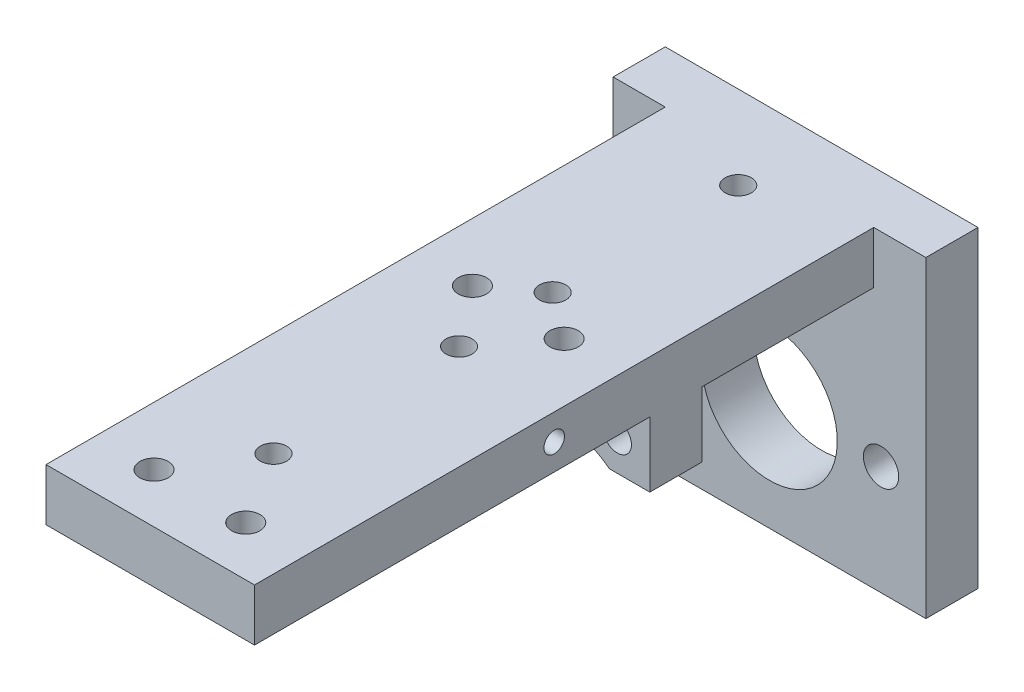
ISO-10303-21;
HEADER;
FILE_DESCRIPTION(('STEP AP214'),'2;1');
FILE_NAME('part.step','',(''),(''),'','','');
FILE_SCHEMA(('AUTOMOTIVE_DESIGN { 1 0 10303 214 1 1 1 1 }'));
ENDSEC;
DATA;
#1=APPLICATION_CONTEXT('core data for automotive mechanical design processes');
#2=APPLICATION_PROTOCOL_DEFINITION('international standard','automotive_design',2000,#1);
#3=PRODUCT_CONTEXT('',#1,'mechanical');
#4=PRODUCT('Part','Part','',(#3));
#5=PRODUCT_RELATED_PRODUCT_CATEGORY('part','',(#4));
#6=PRODUCT_DEFINITION_FORMATION('','',#4);
#7=PRODUCT_DEFINITION_CONTEXT('part definition',#1,'design');
#8=PRODUCT_DEFINITION('design','',#6,#7);
#9=PRODUCT_DEFINITION_SHAPE('','',#8);
#10=(LENGTH_UNIT() NAMED_UNIT(*) SI_UNIT(.MILLI.,.METRE.));
#11=(NAMED_UNIT(*) PLANE_ANGLE_UNIT() SI_UNIT($,.RADIAN.));
#12=(NAMED_UNIT(*) SI_UNIT($,.STERADIAN.) SOLID_ANGLE_UNIT());
#13=UNCERTAINTY_MEASURE_WITH_UNIT(LENGTH_MEASURE(1.E-05),#10,'distance_accuracy_value','');
#14=(GEOMETRIC_REPRESENTATION_CONTEXT(3) GLOBAL_UNCERTAINTY_ASSIGNED_CONTEXT((#13)) GLOBAL_UNIT_ASSIGNED_CONTEXT((#10,
#11,#12)) REPRESENTATION_CONTEXT('',''));
#15=CARTESIAN_POINT('',(0.,0.,0.));
#16=DIRECTION('',(0.,0.,1.));
#17=DIRECTION('',(1.,0.,0.));
#18=AXIS2_PLACEMENT_3D('',#15,#16,#17);
#19=CARTESIAN_POINT('',(-22.8649597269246,-14.2875,27.2796));
#20=DIRECTION('',(0.,-1.,0.));
#21=DIRECTION('',(1.,0.,0.));
#22=AXIS2_PLACEMENT_3D('',#19,#20,#21);
#23=PLANE('',#22);
#24=DIRECTION('',(0.,0.,1.));
#25=VECTOR('',#24,1.);
#26=CARTESIAN_POINT('',(7.79754144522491,-14.2875,-0.00100000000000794));
#27=LINE('',#26,#25);
#28=CARTESIAN_POINT('',(7.79754144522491,-14.2875,33.6296));
#29=VERTEX_POINT('',#28);
#30=CARTESIAN_POINT('',(7.79754144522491,-14.2875,27.2796));
#31=VERTEX_POINT('',#30);
#32=EDGE_CURVE('E47',#29,#31,#27,.F.);
#33=ORIENTED_EDGE('',*,*,#32,.T.);
#34=DIRECTION('',(1.,0.,0.));
#35=VECTOR('',#34,1.);
#36=CARTESIAN_POINT('',(-22.8649597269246,-14.2875,27.2796));
#37=LINE('',#36,#35);
#38=CARTESIAN_POINT('',(12.7,-14.2875,27.2796));
#39=VERTEX_POINT('',#38);
#40=EDGE_CURVE('E242',#31,#39,#37,.T.);
#41=ORIENTED_EDGE('',*,*,#40,.T.);
#42=DIRECTION('',(0.,0.,-1.));
#43=VECTOR('',#42,1.);
#44=CARTESIAN_POINT('',(12.7,-14.2875,27.2796));
#45=LINE('',#44,#43);
#46=CARTESIAN_POINT('',(12.7,-14.2875,33.6296));
#47=VERTEX_POINT('',#46);
#48=EDGE_CURVE('E252',#47,#39,#45,.T.);
#49=ORIENTED_EDGE('',*,*,#48,.F.);
#50=DIRECTION('',(1.,0.,0.));
#51=VECTOR('',#50,1.);
#52=CARTESIAN_POINT('',(-22.8649597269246,-14.2875,33.6296));
#53=LINE('',#52,#51);
#54=EDGE_CURVE('E243',#29,#47,#53,.T.);
#55=ORIENTED_EDGE('',*,*,#54,.F.);
#56=EDGE_LOOP('',(#33,#41,#49,#55));
#57=FACE_BOUND('',#56,.T.);
#58=ADVANCED_FACE('F30',(#57),#23,.T.);
#59=CARTESIAN_POINT('',(19.05,0.,0.));
#60=DIRECTION('',(0.,-1.,0.));
#61=DIRECTION('',(0.,0.,-1.));
#62=AXIS2_PLACEMENT_3D('',#59,#60,#61);
#63=PLANE('',#62);
#64=CARTESIAN_POINT('',(5.588,0.,36.957));
#65=DIRECTION('',(0.,1.,0.));
#66=DIRECTION('',(0.,0.,1.));
#67=AXIS2_PLACEMENT_3D('',#64,#65,#66);
#68=CIRCLE('',#67,1.72719999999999);
#69=CARTESIAN_POINT('',(5.588,0.,38.6842));
#70=VERTEX_POINT('',#69);
#71=EDGE_CURVE('E519',#70,#70,#68,.T.);
#72=ORIENTED_EDGE('',*,*,#71,.F.);
#73=EDGE_LOOP('',(#72));
#74=FACE_BOUND('',#73,.T.);
#75=CARTESIAN_POINT('',(-5.588,0.,75.7428));
#76=DIRECTION('',(0.,1.,0.));
#77=DIRECTION('',(0.,0.,1.));
#78=AXIS2_PLACEMENT_3D('',#75,#76,#77);
#79=CIRCLE('',#78,1.72719999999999);
#80=CARTESIAN_POINT('',(-5.588,0.,77.47));
#81=VERTEX_POINT('',#80);
#82=EDGE_CURVE('E507',#81,#81,#79,.T.);
#83=ORIENTED_EDGE('',*,*,#82,.F.);
#84=EDGE_LOOP('',(#83));
#85=FACE_BOUND('',#84,.T.);
#86=CARTESIAN_POINT('',(0.,0.,32.766));
#87=DIRECTION('',(0.,-1.,0.));
#88=DIRECTION('',(0.,0.,-1.));
#89=AXIS2_PLACEMENT_3D('',#86,#87,#88);
#90=CIRCLE('',#89,1.6);
#91=CARTESIAN_POINT('',(0.,0.,31.166));
#92=VERTEX_POINT('',#91);
#93=EDGE_CURVE('E282',#92,#92,#90,.T.);
#94=ORIENTED_EDGE('',*,*,#93,.T.);
#95=EDGE_LOOP('',(#94));
#96=FACE_BOUND('',#95,.T.);
#97=CARTESIAN_POINT('',(0.,0.,66.7766));
#98=DIRECTION('',(0.,-1.,0.));
#99=DIRECTION('',(0.,0.,-1.));
#100=AXIS2_PLACEMENT_3D('',#97,#98,#99);
#101=CIRCLE('',#100,1.6);
#102=CARTESIAN_POINT('',(0.,0.,65.1766));
#103=VERTEX_POINT('',#102);
#104=EDGE_CURVE('E295',#103,#103,#101,.T.);
#105=ORIENTED_EDGE('',*,*,#104,.T.);
#106=EDGE_LOOP('',(#105));
#107=FACE_BOUND('',#106,.T.);
#108=CARTESIAN_POINT('',(0.,0.,10.16));
#109=DIRECTION('',(0.,-1.,0.));
#110=DIRECTION('',(0.,0.,-1.));
#111=AXIS2_PLACEMENT_3D('',#108,#109,#110);
#112=CIRCLE('',#111,1.6);
#113=CARTESIAN_POINT('',(0.,0.,8.56));
#114=VERTEX_POINT('',#113);
#115=EDGE_CURVE('E307',#114,#114,#112,.T.);
#116=ORIENTED_EDGE('',*,*,#115,.T.);
#117=EDGE_LOOP('',(#116));
#118=FACE_BOUND('',#117,.T.);
#119=CARTESIAN_POINT('',(0.,0.,44.1706));
#120=DIRECTION('',(0.,-1.,0.));
#121=DIRECTION('',(0.,0.,-1.));
#122=AXIS2_PLACEMENT_3D('',#119,#120,#121);
#123=CIRCLE('',#122,1.6);
#124=CARTESIAN_POINT('',(0.,0.,42.5706));
#125=VERTEX_POINT('',#124);
#126=EDGE_CURVE('E319',#125,#125,#123,.T.);
#127=ORIENTED_EDGE('',*,*,#126,.T.);
#128=EDGE_LOOP('',(#127));
#129=FACE_BOUND('',#128,.T.);
#130=DIRECTION('',(1.,0.,0.));
#131=VECTOR('',#130,1.);
#132=CARTESIAN_POINT('',(-19.05,0.,6.35));
#133=LINE('',#132,#131);
#134=CARTESIAN_POINT('',(-19.05,0.,6.35));
#135=VERTEX_POINT('',#134);
#136=CARTESIAN_POINT('',(-12.7,0.,6.35));
#137=VERTEX_POINT('',#136);
#138=EDGE_CURVE('E253',#135,#137,#133,.T.);
#139=ORIENTED_EDGE('',*,*,#138,.T.);
#140=DIRECTION('',(0.,0.,1.));
#141=VECTOR('',#140,1.);
#142=CARTESIAN_POINT('',(-12.7,0.,81.788));
#143=LINE('',#142,#141);
#144=CARTESIAN_POINT('',(-12.7,0.,81.788));
#145=VERTEX_POINT('',#144);
#146=EDGE_CURVE('E256',#137,#145,#143,.T.);
#147=ORIENTED_EDGE('',*,*,#146,.T.);
#148=DIRECTION('',(-1.,0.,0.));
#149=VECTOR('',#148,1.);
#150=CARTESIAN_POINT('',(19.05,0.,81.788));
#151=LINE('',#150,#149);
#152=CARTESIAN_POINT('',(12.7,0.,81.788));
#153=VERTEX_POINT('',#152);
#154=EDGE_CURVE('E39',#153,#145,#151,.T.);
#155=ORIENTED_EDGE('',*,*,#154,.F.);
#156=DIRECTION('',(0.,0.,-1.));
#157=VECTOR('',#156,1.);
#158=CARTESIAN_POINT('',(12.7,0.,81.788));
#159=LINE('',#158,#157);
#160=CARTESIAN_POINT('',(12.7,0.,6.35));
#161=VERTEX_POINT('',#160);
#162=EDGE_CURVE('E269',#153,#161,#159,.T.);
#163=ORIENTED_EDGE('',*,*,#162,.T.);
#164=DIRECTION('',(1.,0.,0.));
#165=VECTOR('',#164,1.);
#166=CARTESIAN_POINT('',(19.05,0.,6.35));
#167=LINE('',#166,#165);
#168=CARTESIAN_POINT('',(19.05,0.,6.35));
#169=VERTEX_POINT('',#168);
#170=EDGE_CURVE('E272',#161,#169,#167,.T.);
#171=ORIENTED_EDGE('',*,*,#170,.T.);
#172=DIRECTION('',(0.,0.,1.));
#173=VECTOR('',#172,1.);
#174=CARTESIAN_POINT('',(19.05,0.,0.));
#175=LINE('',#174,#173);
#176=CARTESIAN_POINT('',(19.05,0.,0.));
#177=VERTEX_POINT('',#176);
#178=EDGE_CURVE('E349',#177,#169,#175,.T.);
#179=ORIENTED_EDGE('',*,*,#178,.F.);
#180=DIRECTION('',(-1.,0.,0.));
#181=VECTOR('',#180,1.);
#182=CARTESIAN_POINT('',(19.05,0.,0.));
#183=LINE('',#182,#181);
#184=CARTESIAN_POINT('',(-19.05,0.,0.));
#185=VERTEX_POINT('',#184);
#186=EDGE_CURVE('E11',#177,#185,#183,.T.);
#187=ORIENTED_EDGE('',*,*,#186,.T.);
#188=DIRECTION('',(0.,0.,1.));
#189=VECTOR('',#188,1.);
#190=CARTESIAN_POINT('',(-19.05,0.,0.));
#191=LINE('',#190,#189);
#192=EDGE_CURVE('E360',#185,#135,#191,.T.);
#193=ORIENTED_EDGE('',*,*,#192,.T.);
#194=EDGE_LOOP('',(#139,#147,#155,#163,#171,#179,#187,#193));
#195=FACE_BOUND('',#194,.T.);
#196=CARTESIAN_POINT('',(5.588,0.,75.7428));
#197=DIRECTION('',(0.,1.,0.));
#198=DIRECTION('',(0.,0.,1.));
#199=AXIS2_PLACEMENT_3D('',#196,#197,#198);
#200=CIRCLE('',#199,1.72719999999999);
#201=CARTESIAN_POINT('',(5.588,0.,77.47));
#202=VERTEX_POINT('',#201);
#203=EDGE_CURVE('E513',#202,#202,#200,.T.);
#204=ORIENTED_EDGE('',*,*,#203,.F.);
#205=EDGE_LOOP('',(#204));
#206=FACE_BOUND('',#205,.T.);
#207=CARTESIAN_POINT('',(-5.588,0.,36.957));
#208=DIRECTION('',(0.,1.,0.));
#209=DIRECTION('',(0.,0.,1.));
#210=AXIS2_PLACEMENT_3D('',#207,#208,#209);
#211=CIRCLE('',#210,1.72719999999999);
#212=CARTESIAN_POINT('',(-5.588,0.,38.6842));
#213=VERTEX_POINT('',#212);
#214=EDGE_CURVE('E489',#213,#213,#211,.T.);
#215=ORIENTED_EDGE('',*,*,#214,.F.);
#216=EDGE_LOOP('',(#215));
#217=FACE_BOUND('',#216,.T.);
#218=ADVANCED_FACE('F206',(#74,#85,#96,#107,#118,#129,#195,#206,#217),#63,.F.);
#219=CARTESIAN_POINT('',(-22.8649597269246,-6.35000000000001,33.6296));
#220=DIRECTION('',(0.,0.,1.));
#221=DIRECTION('',(1.,0.,0.));
#222=AXIS2_PLACEMENT_3D('',#219,#220,#221);
#223=PLANE('',#222);
#224=CARTESIAN_POINT('',(0.,-24.7904,33.6296));
#225=DIRECTION('',(0.,0.,1.));
#226=DIRECTION('',(1.,0.,0.));
#227=AXIS2_PLACEMENT_3D('',#224,#225,#226);
#228=CIRCLE('',#227,13.081);
#229=CARTESIAN_POINT('',(-3.13316055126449,-12.0901690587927,33.6296));
#230=VERTEX_POINT('',#229);
#231=CARTESIAN_POINT('',(-7.79754144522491,-14.2875,33.6296));
#232=VERTEX_POINT('',#231);
#233=EDGE_CURVE('E178',#230,#232,#228,.T.);
#234=ORIENTED_EDGE('',*,*,#233,.F.);
#235=DIRECTION('',(0.,-1.,0.));
#236=VECTOR('',#235,1.);
#237=CARTESIAN_POINT('',(-3.13316055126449,0.00100000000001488,33.6296));
#238=LINE('',#237,#236);
#239=CARTESIAN_POINT('',(-3.13316055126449,-6.35000000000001,33.6296));
#240=VERTEX_POINT('',#239);
#241=EDGE_CURVE('E454',#230,#240,#238,.F.);
#242=ORIENTED_EDGE('',*,*,#241,.T.);
#243=DIRECTION('',(1.,0.,0.));
#244=VECTOR('',#243,1.);
#245=CARTESIAN_POINT('',(-22.8649597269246,-6.35000000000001,33.6296));
#246=LINE('',#245,#244);
#247=CARTESIAN_POINT('',(-12.7,-6.35,33.6296));
#248=VERTEX_POINT('',#247);
#249=EDGE_CURVE('E55',#248,#240,#246,.T.);
#250=ORIENTED_EDGE('',*,*,#249,.F.);
#251=DIRECTION('',(0.,1.,0.));
#252=VECTOR('',#251,1.);
#253=CARTESIAN_POINT('',(-12.7,-6.35000000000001,33.6296));
#254=LINE('',#253,#252);
#255=CARTESIAN_POINT('',(-12.7,-14.2875,33.6296));
#256=VERTEX_POINT('',#255);
#257=EDGE_CURVE('E241',#256,#248,#254,.T.);
#258=ORIENTED_EDGE('',*,*,#257,.F.);
#259=EDGE_CURVE('E234',#256,#232,#53,.T.);
#260=ORIENTED_EDGE('',*,*,#259,.T.);
#261=EDGE_LOOP('',(#234,#242,#250,#258,#260));
#262=FACE_BOUND('',#261,.T.);
#263=CARTESIAN_POINT('',(-8.7376,-10.414,33.6296));
#264=DIRECTION('',(0.,0.,1.));
#265=DIRECTION('',(1.,0.,0.));
#266=AXIS2_PLACEMENT_3D('',#263,#264,#265);
#267=CIRCLE('',#266,1.72719999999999);
#268=CARTESIAN_POINT('',(-7.01040000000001,-10.414,33.6296));
#269=VERTEX_POINT('',#268);
#270=EDGE_CURVE('E501',#269,#269,#267,.T.);
#271=ORIENTED_EDGE('',*,*,#270,.F.);
#272=EDGE_LOOP('',(#271));
#273=FACE_BOUND('',#272,.T.);
#274=ADVANCED_FACE('F213',(#262,#273),#223,.T.);
#275=CARTESIAN_POINT('',(19.05,-6.35,6.35));
#276=DIRECTION('',(0.,1.,0.));
#277=DIRECTION('',(0.,0.,1.));
#278=AXIS2_PLACEMENT_3D('',#275,#276,#277);
#279=PLANE('',#278);
#280=CARTESIAN_POINT('',(0.,-6.35,10.16));
#281=DIRECTION('',(0.,-1.,0.));
#282=DIRECTION('',(0.,0.,-1.));
#283=AXIS2_PLACEMENT_3D('',#280,#281,#282);
#284=CIRCLE('',#283,3.25);
#285=CARTESIAN_POINT('',(0.,-6.35,6.91));
#286=VERTEX_POINT('',#285);
#287=EDGE_CURVE('E316',#286,#286,#284,.T.);
#288=ORIENTED_EDGE('',*,*,#287,.F.);
#289=EDGE_LOOP('',(#288));
#290=FACE_BOUND('',#289,.T.);
#291=DIRECTION('',(0.,0.,-1.));
#292=VECTOR('',#291,1.);
#293=CARTESIAN_POINT('',(12.7,-6.35000000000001,81.788));
#294=LINE('',#293,#292);
#295=CARTESIAN_POINT('',(12.7,-6.35000000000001,27.2796));
#296=VERTEX_POINT('',#295);
#297=CARTESIAN_POINT('',(12.7,-6.35,6.35));
#298=VERTEX_POINT('',#297);
#299=EDGE_CURVE('E267',#296,#298,#294,.T.);
#300=ORIENTED_EDGE('',*,*,#299,.F.);
#301=DIRECTION('',(1.,0.,0.));
#302=VECTOR('',#301,1.);
#303=CARTESIAN_POINT('',(-22.8649597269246,-6.35000000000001,27.2796));
#304=LINE('',#303,#302);
#305=CARTESIAN_POINT('',(-12.7,-6.35000000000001,27.2796));
#306=VERTEX_POINT('',#305);
#307=EDGE_CURVE('E250',#306,#296,#304,.T.);
#308=ORIENTED_EDGE('',*,*,#307,.F.);
#309=DIRECTION('',(0.,0.,1.));
#310=VECTOR('',#309,1.);
#311=CARTESIAN_POINT('',(-12.7,-6.35000000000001,81.788));
#312=LINE('',#311,#310);
#313=CARTESIAN_POINT('',(-12.7,-6.35,6.35));
#314=VERTEX_POINT('',#313);
#315=EDGE_CURVE('E257',#314,#306,#312,.T.);
#316=ORIENTED_EDGE('',*,*,#315,.F.);
#317=DIRECTION('',(-1.,0.,0.));
#318=VECTOR('',#317,1.);
#319=CARTESIAN_POINT('',(19.05,-6.35,6.35));
#320=LINE('',#319,#318);
#321=EDGE_CURVE('E371',#298,#314,#320,.T.);
#322=ORIENTED_EDGE('',*,*,#321,.F.);
#323=EDGE_LOOP('',(#300,#308,#316,#322));
#324=FACE_BOUND('',#323,.T.);
#325=ADVANCED_FACE('F426',(#290,#324),#279,.F.);
#326=CARTESIAN_POINT('',(19.05,0.,0.));
#327=DIRECTION('',(0.,0.,1.));
#328=DIRECTION('',(0.,-1.,0.));
#329=AXIS2_PLACEMENT_3D('',#326,#327,#328);
#330=PLANE('',#329);
#331=CARTESIAN_POINT('',(13.589,-24.7904,0.));
#332=DIRECTION('',(0.,0.,-1.));
#333=DIRECTION('',(0.,1.,0.));
#334=AXIS2_PLACEMENT_3D('',#331,#332,#333);
#335=CIRCLE('',#334,2.15265);
#336=CARTESIAN_POINT('',(13.589,-22.63775,0.));
#337=VERTEX_POINT('',#336);
#338=EDGE_CURVE('E331',#337,#337,#335,.T.);
#339=ORIENTED_EDGE('',*,*,#338,.F.);
#340=EDGE_LOOP('',(#339));
#341=FACE_BOUND('',#340,.T.);
#342=CARTESIAN_POINT('',(-13.589,-24.7904,0.));
#343=DIRECTION('',(0.,0.,-1.));
#344=DIRECTION('',(0.,1.,0.));
#345=AXIS2_PLACEMENT_3D('',#342,#343,#344);
#346=CIRCLE('',#345,2.15265);
#347=CARTESIAN_POINT('',(-13.589,-22.63775,0.));
#348=VERTEX_POINT('',#347);
#349=EDGE_CURVE('E335',#348,#348,#346,.T.);
#350=ORIENTED_EDGE('',*,*,#349,.F.);
#351=EDGE_LOOP('',(#350));
#352=FACE_BOUND('',#351,.T.);
#353=CARTESIAN_POINT('',(0.,-24.7904,0.));
#354=DIRECTION('',(0.,0.,-1.));
#355=DIRECTION('',(0.,1.,0.));
#356=AXIS2_PLACEMENT_3D('',#353,#354,#355);
#357=CIRCLE('',#356,8.255);
#358=CARTESIAN_POINT('',(0.,-16.5354,0.));
#359=VERTEX_POINT('',#358);
#360=EDGE_CURVE('E339',#359,#359,#357,.T.);
#361=ORIENTED_EDGE('',*,*,#360,.F.);
#362=EDGE_LOOP('',(#361));
#363=FACE_BOUND('',#362,.T.);
#364=DIRECTION('',(0.,1.,0.));
#365=VECTOR('',#364,1.);
#366=CARTESIAN_POINT('',(-19.05,0.,0.));
#367=LINE('',#366,#365);
#368=CARTESIAN_POINT('',(-19.05,-38.1,0.));
#369=VERTEX_POINT('',#368);
#370=EDGE_CURVE('E345',#369,#185,#367,.T.);
#371=ORIENTED_EDGE('',*,*,#370,.T.);
#372=ORIENTED_EDGE('',*,*,#186,.F.);
#373=DIRECTION('',(0.,1.,0.));
#374=VECTOR('',#373,1.);
#375=CARTESIAN_POINT('',(19.05,0.,0.));
#376=LINE('',#375,#374);
#377=CARTESIAN_POINT('',(19.05,-38.1,0.));
#378=VERTEX_POINT('',#377);
#379=EDGE_CURVE('E346',#378,#177,#376,.T.);
#380=ORIENTED_EDGE('',*,*,#379,.F.);
#381=DIRECTION('',(-1.,0.,0.));
#382=VECTOR('',#381,1.);
#383=CARTESIAN_POINT('',(19.05,-38.1,0.));
#384=LINE('',#383,#382);
#385=EDGE_CURVE('E357',#378,#369,#384,.T.);
#386=ORIENTED_EDGE('',*,*,#385,.T.);
#387=EDGE_LOOP('',(#371,#372,#380,#386));
#388=FACE_BOUND('',#387,.T.);
#389=ADVANCED_FACE('F32',(#341,#352,#363,#388),#330,.F.);
#390=CARTESIAN_POINT('',(19.05,-6.35000000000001,81.788));
#391=DIRECTION('',(0.,0.,-1.));
#392=DIRECTION('',(-1.,0.,0.));
#393=AXIS2_PLACEMENT_3D('',#390,#391,#392);
#394=PLANE('',#393);
#395=ORIENTED_EDGE('',*,*,#154,.T.);
#396=DIRECTION('',(0.,-1.,0.));
#397=VECTOR('',#396,1.);
#398=CARTESIAN_POINT('',(-12.7,0.,81.788));
#399=LINE('',#398,#397);
#400=CARTESIAN_POINT('',(-12.7,-6.35000000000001,81.788));
#401=VERTEX_POINT('',#400);
#402=EDGE_CURVE('E264',#145,#401,#399,.T.);
#403=ORIENTED_EDGE('',*,*,#402,.T.);
#404=DIRECTION('',(-1.,0.,0.));
#405=VECTOR('',#404,1.);
#406=CARTESIAN_POINT('',(19.05,-6.35000000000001,81.788));
#407=LINE('',#406,#405);
#408=CARTESIAN_POINT('',(12.7,-6.35000000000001,81.788));
#409=VERTEX_POINT('',#408);
#410=EDGE_CURVE('E374',#409,#401,#407,.T.);
#411=ORIENTED_EDGE('',*,*,#410,.F.);
#412=DIRECTION('',(0.,-1.,0.));
#413=VECTOR('',#412,1.);
#414=CARTESIAN_POINT('',(12.7,0.,81.788));
#415=LINE('',#414,#413);
#416=EDGE_CURVE('E276',#153,#409,#415,.T.);
#417=ORIENTED_EDGE('',*,*,#416,.F.);
#418=EDGE_LOOP('',(#395,#403,#411,#417));
#419=FACE_BOUND('',#418,.T.);
#420=ADVANCED_FACE('F424',(#419),#394,.F.);
#421=CARTESIAN_POINT('',(-5.588,-6.35,36.957));
#422=DIRECTION('',(0.,1.,0.));
#423=DIRECTION('',(0.,0.,1.));
#424=AXIS2_PLACEMENT_3D('',#421,#422,#423);
#425=CIRCLE('',#424,1.72719999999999);
#426=CARTESIAN_POINT('',(-5.588,-6.35,38.6842));
#427=VERTEX_POINT('',#426);
#428=EDGE_CURVE('E522',#427,#427,#425,.T.);
#429=ORIENTED_EDGE('',*,*,#428,.T.);
#430=EDGE_LOOP('',(#429));
#431=FACE_BOUND('',#430,.T.);
#432=CARTESIAN_POINT('',(5.588,-6.35,36.957));
#433=DIRECTION('',(0.,1.,0.));
#434=DIRECTION('',(0.,0.,1.));
#435=AXIS2_PLACEMENT_3D('',#432,#433,#434);
#436=CIRCLE('',#435,1.72719999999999);
#437=CARTESIAN_POINT('',(5.588,-6.35,38.6842));
#438=VERTEX_POINT('',#437);
#439=EDGE_CURVE('E516',#438,#438,#436,.T.);
#440=ORIENTED_EDGE('',*,*,#439,.T.);
#441=EDGE_LOOP('',(#440));
#442=FACE_BOUND('',#441,.T.);
#443=CARTESIAN_POINT('',(5.588,-6.35000000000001,75.7428));
#444=DIRECTION('',(0.,1.,0.));
#445=DIRECTION('',(0.,0.,1.));
#446=AXIS2_PLACEMENT_3D('',#443,#444,#445);
#447=CIRCLE('',#446,1.72719999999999);
#448=CARTESIAN_POINT('',(5.588,-6.35000000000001,77.47));
#449=VERTEX_POINT('',#448);
#450=EDGE_CURVE('E510',#449,#449,#447,.T.);
#451=ORIENTED_EDGE('',*,*,#450,.T.);
#452=EDGE_LOOP('',(#451));
#453=FACE_BOUND('',#452,.T.);
#454=CARTESIAN_POINT('',(-5.588,-6.35000000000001,75.7428));
#455=DIRECTION('',(0.,1.,0.));
#456=DIRECTION('',(0.,0.,1.));
#457=AXIS2_PLACEMENT_3D('',#454,#455,#456);
#458=CIRCLE('',#457,1.72719999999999);
#459=CARTESIAN_POINT('',(-5.588,-6.35000000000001,77.47));
#460=VERTEX_POINT('',#459);
#461=EDGE_CURVE('E504',#460,#460,#458,.T.);
#462=ORIENTED_EDGE('',*,*,#461,.T.);
#463=EDGE_LOOP('',(#462));
#464=FACE_BOUND('',#463,.T.);
#465=EDGE_CURVE('E263',#248,#401,#312,.T.);
#466=ORIENTED_EDGE('',*,*,#465,.F.);
#467=ORIENTED_EDGE('',*,*,#249,.T.);
#468=CARTESIAN_POINT('',(0.,-6.35,32.766));
#469=DIRECTION('',(0.,-1.,0.));
#470=DIRECTION('',(0.,0.,-1.));
#471=AXIS2_PLACEMENT_3D('',#468,#469,#470);
#472=CIRCLE('',#471,3.25);
#473=CARTESIAN_POINT('',(3.13316055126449,-6.35000000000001,33.6296));
#474=VERTEX_POINT('',#473);
#475=EDGE_CURVE('E292',#474,#240,#472,.T.);
#476=ORIENTED_EDGE('',*,*,#475,.F.);
#477=CARTESIAN_POINT('',(12.7,-6.35000000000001,33.6296));
#478=VERTEX_POINT('',#477);
#479=EDGE_CURVE('E249',#474,#478,#246,.T.);
#480=ORIENTED_EDGE('',*,*,#479,.T.);
#481=EDGE_CURVE('E273',#409,#478,#294,.T.);
#482=ORIENTED_EDGE('',*,*,#481,.F.);
#483=ORIENTED_EDGE('',*,*,#410,.T.);
#484=EDGE_LOOP('',(#466,#467,#476,#480,#482,#483));
#485=FACE_BOUND('',#484,.T.);
#486=CARTESIAN_POINT('',(0.,-6.35,66.7766));
#487=DIRECTION('',(0.,-1.,0.));
#488=DIRECTION('',(0.,0.,-1.));
#489=AXIS2_PLACEMENT_3D('',#486,#487,#488);
#490=CIRCLE('',#489,3.25);
#491=CARTESIAN_POINT('',(0.,-6.35,63.5266));
#492=VERTEX_POINT('',#491);
#493=EDGE_CURVE('E304',#492,#492,#490,.T.);
#494=ORIENTED_EDGE('',*,*,#493,.F.);
#495=EDGE_LOOP('',(#494));
#496=FACE_BOUND('',#495,.T.);
#497=CARTESIAN_POINT('',(0.,-6.35,44.1706));
#498=DIRECTION('',(0.,-1.,0.));
#499=DIRECTION('',(0.,0.,-1.));
#500=AXIS2_PLACEMENT_3D('',#497,#498,#499);
#501=CIRCLE('',#500,3.25);
#502=CARTESIAN_POINT('',(0.,-6.35,40.9206));
#503=VERTEX_POINT('',#502);
#504=EDGE_CURVE('E328',#503,#503,#501,.T.);
#505=ORIENTED_EDGE('',*,*,#504,.F.);
#506=EDGE_LOOP('',(#505));
#507=FACE_BOUND('',#506,.T.);
#508=ADVANCED_FACE('F421',(#431,#442,#453,#464,#485,#496,#507),#279,.F.);
#509=CARTESIAN_POINT('',(19.05,-6.35,6.35));
#510=DIRECTION('',(0.,0.,-1.));
#511=DIRECTION('',(0.,1.,0.));
#512=AXIS2_PLACEMENT_3D('',#509,#510,#511);
#513=PLANE('',#512);
#514=CARTESIAN_POINT('',(13.589,-24.7904,6.35));
#515=DIRECTION('',(0.,0.,-1.));
#516=DIRECTION('',(0.,1.,0.));
#517=AXIS2_PLACEMENT_3D('',#514,#515,#516);
#518=CIRCLE('',#517,2.15264999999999);
#519=CARTESIAN_POINT('',(13.589,-22.63775,6.35));
#520=VERTEX_POINT('',#519);
#521=EDGE_CURVE('E334',#520,#520,#518,.T.);
#522=ORIENTED_EDGE('',*,*,#521,.T.);
#523=EDGE_LOOP('',(#522));
#524=FACE_BOUND('',#523,.T.);
#525=CARTESIAN_POINT('',(-13.589,-24.7904,6.35));
#526=DIRECTION('',(0.,0.,-1.));
#527=DIRECTION('',(0.,1.,0.));
#528=AXIS2_PLACEMENT_3D('',#525,#526,#527);
#529=CIRCLE('',#528,2.15264999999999);
#530=CARTESIAN_POINT('',(-13.589,-22.63775,6.35));
#531=VERTEX_POINT('',#530);
#532=EDGE_CURVE('E338',#531,#531,#529,.T.);
#533=ORIENTED_EDGE('',*,*,#532,.T.);
#534=EDGE_LOOP('',(#533));
#535=FACE_BOUND('',#534,.T.);
#536=CARTESIAN_POINT('',(0.,-24.7904,6.34999999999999));
#537=DIRECTION('',(0.,0.,-1.));
#538=DIRECTION('',(0.,1.,0.));
#539=AXIS2_PLACEMENT_3D('',#536,#537,#538);
#540=CIRCLE('',#539,8.255);
#541=CARTESIAN_POINT('',(0.,-16.5354,6.35));
#542=VERTEX_POINT('',#541);
#543=EDGE_CURVE('E342',#542,#542,#540,.F.);
#544=ORIENTED_EDGE('',*,*,#543,.F.);
#545=EDGE_LOOP('',(#544));
#546=FACE_BOUND('',#545,.T.);
#547=DIRECTION('',(0.,-1.,0.));
#548=VECTOR('',#547,1.);
#549=CARTESIAN_POINT('',(-19.05,-6.35,6.35));
#550=LINE('',#549,#548);
#551=CARTESIAN_POINT('',(-19.05,-38.1,6.35));
#552=VERTEX_POINT('',#551);
#553=EDGE_CURVE('E363',#135,#552,#550,.T.);
#554=ORIENTED_EDGE('',*,*,#553,.T.);
#555=DIRECTION('',(-1.,0.,0.));
#556=VECTOR('',#555,1.);
#557=CARTESIAN_POINT('',(19.05,-38.1,6.35));
#558=LINE('',#557,#556);
#559=CARTESIAN_POINT('',(19.05,-38.1,6.35));
#560=VERTEX_POINT('',#559);
#561=EDGE_CURVE('E368',#560,#552,#558,.T.);
#562=ORIENTED_EDGE('',*,*,#561,.F.);
#563=DIRECTION('',(0.,-1.,0.));
#564=VECTOR('',#563,1.);
#565=CARTESIAN_POINT('',(19.05,-6.35,6.35));
#566=LINE('',#565,#564);
#567=EDGE_CURVE('E353',#169,#560,#566,.T.);
#568=ORIENTED_EDGE('',*,*,#567,.F.);
#569=ORIENTED_EDGE('',*,*,#170,.F.);
#570=DIRECTION('',(0.,-1.,0.));
#571=VECTOR('',#570,1.);
#572=CARTESIAN_POINT('',(12.7,0.,6.35));
#573=LINE('',#572,#571);
#574=EDGE_CURVE('E279',#161,#298,#573,.T.);
#575=ORIENTED_EDGE('',*,*,#574,.T.);
#576=ORIENTED_EDGE('',*,*,#321,.T.);
#577=DIRECTION('',(0.,-1.,0.));
#578=VECTOR('',#577,1.);
#579=CARTESIAN_POINT('',(-12.7,0.,6.35));
#580=LINE('',#579,#578);
#581=EDGE_CURVE('E260',#137,#314,#580,.T.);
#582=ORIENTED_EDGE('',*,*,#581,.F.);
#583=ORIENTED_EDGE('',*,*,#138,.F.);
#584=EDGE_LOOP('',(#554,#562,#568,#569,#575,#576,#582,#583));
#585=FACE_BOUND('',#584,.T.);
#586=ADVANCED_FACE('F383',(#524,#535,#546,#585),#513,.F.);
#587=CARTESIAN_POINT('',(19.05,-38.1,6.35));
#588=DIRECTION('',(0.,1.,0.));
#589=DIRECTION('',(0.,0.,1.));
#590=AXIS2_PLACEMENT_3D('',#587,#588,#589);
#591=PLANE('',#590);
#592=DIRECTION('',(0.,0.,-1.));
#593=VECTOR('',#592,1.);
#594=CARTESIAN_POINT('',(-19.05,-38.1,6.35));
#595=LINE('',#594,#593);
#596=EDGE_CURVE('E350',#552,#369,#595,.T.);
#597=ORIENTED_EDGE('',*,*,#596,.T.);
#598=ORIENTED_EDGE('',*,*,#385,.F.);
#599=DIRECTION('',(0.,0.,-1.));
#600=VECTOR('',#599,1.);
#601=CARTESIAN_POINT('',(19.05,-38.1,6.35));
#602=LINE('',#601,#600);
#603=EDGE_CURVE('E355',#560,#378,#602,.T.);
#604=ORIENTED_EDGE('',*,*,#603,.F.);
#605=ORIENTED_EDGE('',*,*,#561,.T.);
#606=EDGE_LOOP('',(#597,#598,#604,#605));
#607=FACE_BOUND('',#606,.T.);
#608=ADVANCED_FACE('F411',(#607),#591,.F.);
#609=CARTESIAN_POINT('',(19.05,0.,0.));
#610=DIRECTION('',(-1.,0.,0.));
#611=DIRECTION('',(0.,0.,1.));
#612=AXIS2_PLACEMENT_3D('',#609,#610,#611);
#613=PLANE('',#612);
#614=ORIENTED_EDGE('',*,*,#178,.T.);
#615=ORIENTED_EDGE('',*,*,#567,.T.);
#616=ORIENTED_EDGE('',*,*,#603,.T.);
#617=ORIENTED_EDGE('',*,*,#379,.T.);
#618=EDGE_LOOP('',(#614,#615,#616,#617));
#619=FACE_BOUND('',#618,.T.);
#620=ADVANCED_FACE('F408',(#619),#613,.F.);
#621=CARTESIAN_POINT('',(-19.05,0.,0.));
#622=DIRECTION('',(-1.,0.,0.));
#623=DIRECTION('',(0.,0.,1.));
#624=AXIS2_PLACEMENT_3D('',#621,#622,#623);
#625=PLANE('',#624);
#626=CARTESIAN_POINT('',(-19.05,-18.4404,3.175));
#627=DIRECTION('',(-1.,0.,0.));
#628=DIRECTION('',(0.,0.,1.));
#629=AXIS2_PLACEMENT_3D('',#626,#627,#628);
#630=CIRCLE('',#629,1.7272);
#631=CARTESIAN_POINT('',(-19.05,-18.4404,4.9022));
#632=VERTEX_POINT('',#631);
#633=EDGE_CURVE('E937',#632,#632,#630,.T.);
#634=ORIENTED_EDGE('',*,*,#633,.F.);
#635=EDGE_LOOP('',(#634));
#636=FACE_BOUND('',#635,.T.);
#637=CARTESIAN_POINT('',(-19.05,-31.1404,3.175));
#638=DIRECTION('',(-1.,0.,0.));
#639=DIRECTION('',(0.,0.,1.));
#640=AXIS2_PLACEMENT_3D('',#637,#638,#639);
#641=CIRCLE('',#640,1.7272);
#642=CARTESIAN_POINT('',(-19.05,-31.1404,4.9022));
#643=VERTEX_POINT('',#642);
#644=EDGE_CURVE('E158',#643,#643,#641,.T.);
#645=ORIENTED_EDGE('',*,*,#644,.F.);
#646=EDGE_LOOP('',(#645));
#647=FACE_BOUND('',#646,.T.);
#648=ORIENTED_EDGE('',*,*,#553,.F.);
#649=ORIENTED_EDGE('',*,*,#192,.F.);
#650=ORIENTED_EDGE('',*,*,#370,.F.);
#651=ORIENTED_EDGE('',*,*,#596,.F.);
#652=EDGE_LOOP('',(#648,#649,#650,#651));
#653=FACE_BOUND('',#652,.T.);
#654=ADVANCED_FACE('F406',(#636,#647,#653),#625,.T.);
#655=CARTESIAN_POINT('',(0.,-24.7904,81.789));
#656=DIRECTION('',(0.,0.,-1.));
#657=DIRECTION('',(0.,1.,0.));
#658=AXIS2_PLACEMENT_3D('',#655,#656,#657);
#659=CYLINDRICAL_SURFACE('',#658,8.255);
#660=ORIENTED_EDGE('',*,*,#360,.T.);
#661=EDGE_LOOP('',(#660));
#662=FACE_BOUND('',#661,.T.);
#663=ORIENTED_EDGE('',*,*,#543,.T.);
#664=EDGE_LOOP('',(#663));
#665=FACE_BOUND('',#664,.T.);
#666=ADVANCED_FACE('F399',(#662,#665),#659,.F.);
#667=CARTESIAN_POINT('',(-13.589,-24.7904,0.));
#668=DIRECTION('',(0.,0.,-1.));
#669=DIRECTION('',(0.,1.,0.));
#670=AXIS2_PLACEMENT_3D('',#667,#668,#669);
#671=CYLINDRICAL_SURFACE('',#670,2.15264999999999);
#672=ORIENTED_EDGE('',*,*,#349,.T.);
#673=EDGE_LOOP('',(#672));
#674=FACE_BOUND('',#673,.T.);
#675=ORIENTED_EDGE('',*,*,#532,.F.);
#676=EDGE_LOOP('',(#675));
#677=FACE_BOUND('',#676,.T.);
#678=ADVANCED_FACE('F389',(#674,#677),#671,.F.);
#679=CARTESIAN_POINT('',(13.589,-24.7904,0.));
#680=DIRECTION('',(0.,0.,-1.));
#681=DIRECTION('',(0.,1.,0.));
#682=AXIS2_PLACEMENT_3D('',#679,#680,#681);
#683=CYLINDRICAL_SURFACE('',#682,2.15264999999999);
#684=ORIENTED_EDGE('',*,*,#338,.T.);
#685=EDGE_LOOP('',(#684));
#686=FACE_BOUND('',#685,.T.);
#687=ORIENTED_EDGE('',*,*,#521,.F.);
#688=EDGE_LOOP('',(#687));
#689=FACE_BOUND('',#688,.T.);
#690=ADVANCED_FACE('F386',(#686,#689),#683,.F.);
#691=CARTESIAN_POINT('',(0.,-6.35,44.1706));
#692=DIRECTION('',(0.,-1.,0.));
#693=DIRECTION('',(0.,0.,-1.));
#694=AXIS2_PLACEMENT_3D('',#691,#692,#693);
#695=CYLINDRICAL_SURFACE('',#694,3.25);
#696=CARTESIAN_POINT('',(0.,-3.35,44.1706));
#697=DIRECTION('',(0.,-1.,0.));
#698=DIRECTION('',(0.,0.,-1.));
#699=AXIS2_PLACEMENT_3D('',#696,#697,#698);
#700=CIRCLE('',#699,3.25);
#701=CARTESIAN_POINT('',(0.,-3.35,40.9206));
#702=VERTEX_POINT('',#701);
#703=EDGE_CURVE('E325',#702,#702,#700,.T.);
#704=ORIENTED_EDGE('',*,*,#703,.F.);
#705=EDGE_LOOP('',(#704));
#706=FACE_BOUND('',#705,.T.);
#707=ORIENTED_EDGE('',*,*,#504,.T.);
#708=EDGE_LOOP('',(#707));
#709=FACE_BOUND('',#708,.T.);
#710=ADVANCED_FACE('F388',(#706,#709),#695,.F.);
#711=CARTESIAN_POINT('',(1.6,-3.35,44.1706));
#712=DIRECTION('',(0.,1.,0.));
#713=DIRECTION('',(0.,0.,1.));
#714=AXIS2_PLACEMENT_3D('',#711,#712,#713);
#715=PLANE('',#714);
#716=CARTESIAN_POINT('',(0.,-3.35,44.1706));
#717=DIRECTION('',(0.,-1.,0.));
#718=DIRECTION('',(0.,0.,-1.));
#719=AXIS2_PLACEMENT_3D('',#716,#717,#718);
#720=CIRCLE('',#719,1.6);
#721=CARTESIAN_POINT('',(0.,-3.35,42.5706));
#722=VERTEX_POINT('',#721);
#723=EDGE_CURVE('E322',#722,#722,#720,.T.);
#724=ORIENTED_EDGE('',*,*,#723,.F.);
#725=EDGE_LOOP('',(#724));
#726=FACE_BOUND('',#725,.T.);
#727=ORIENTED_EDGE('',*,*,#703,.T.);
#728=EDGE_LOOP('',(#727));
#729=FACE_BOUND('',#728,.T.);
#730=ADVANCED_FACE('F396',(#726,#729),#715,.F.);
#731=CARTESIAN_POINT('',(0.,-6.35,44.1706));
#732=DIRECTION('',(0.,-1.,0.));
#733=DIRECTION('',(0.,0.,-1.));
#734=AXIS2_PLACEMENT_3D('',#731,#732,#733);
#735=CYLINDRICAL_SURFACE('',#734,1.6);
#736=ORIENTED_EDGE('',*,*,#126,.F.);
#737=EDGE_LOOP('',(#736));
#738=FACE_BOUND('',#737,.T.);
#739=ORIENTED_EDGE('',*,*,#723,.T.);
#740=EDGE_LOOP('',(#739));
#741=FACE_BOUND('',#740,.T.);
#742=ADVANCED_FACE('F722',(#738,#741),#735,.F.);
#743=CARTESIAN_POINT('',(0.,-6.35,10.16));
#744=DIRECTION('',(0.,-1.,0.));
#745=DIRECTION('',(0.,0.,-1.));
#746=AXIS2_PLACEMENT_3D('',#743,#744,#745);
#747=CYLINDRICAL_SURFACE('',#746,3.25);
#748=CARTESIAN_POINT('',(0.,-3.35,10.16));
#749=DIRECTION('',(0.,-1.,0.));
#750=DIRECTION('',(0.,0.,-1.));
#751=AXIS2_PLACEMENT_3D('',#748,#749,#750);
#752=CIRCLE('',#751,3.25);
#753=CARTESIAN_POINT('',(0.,-3.35,6.91));
#754=VERTEX_POINT('',#753);
#755=EDGE_CURVE('E313',#754,#754,#752,.T.);
#756=ORIENTED_EDGE('',*,*,#755,.F.);
#757=EDGE_LOOP('',(#756));
#758=FACE_BOUND('',#757,.T.);
#759=ORIENTED_EDGE('',*,*,#287,.T.);
#760=EDGE_LOOP('',(#759));
#761=FACE_BOUND('',#760,.T.);
#762=ADVANCED_FACE('F731',(#758,#761),#747,.F.);
#763=CARTESIAN_POINT('',(1.6,-3.35,10.16));
#764=DIRECTION('',(0.,1.,0.));
#765=DIRECTION('',(0.,0.,1.));
#766=AXIS2_PLACEMENT_3D('',#763,#764,#765);
#767=PLANE('',#766);
#768=CARTESIAN_POINT('',(0.,-3.35,10.16));
#769=DIRECTION('',(0.,-1.,0.));
#770=DIRECTION('',(0.,0.,-1.));
#771=AXIS2_PLACEMENT_3D('',#768,#769,#770);
#772=CIRCLE('',#771,1.6);
#773=CARTESIAN_POINT('',(0.,-3.35,8.56));
#774=VERTEX_POINT('',#773);
#775=EDGE_CURVE('E310',#774,#774,#772,.T.);
#776=ORIENTED_EDGE('',*,*,#775,.F.);
#777=EDGE_LOOP('',(#776));
#778=FACE_BOUND('',#777,.T.);
#779=ORIENTED_EDGE('',*,*,#755,.T.);
#780=EDGE_LOOP('',(#779));
#781=FACE_BOUND('',#780,.T.);
#782=ADVANCED_FACE('F741',(#778,#781),#767,.F.);
#783=CARTESIAN_POINT('',(0.,-6.35,10.16));
#784=DIRECTION('',(0.,-1.,0.));
#785=DIRECTION('',(0.,0.,-1.));
#786=AXIS2_PLACEMENT_3D('',#783,#784,#785);
#787=CYLINDRICAL_SURFACE('',#786,1.6);
#788=ORIENTED_EDGE('',*,*,#115,.F.);
#789=EDGE_LOOP('',(#788));
#790=FACE_BOUND('',#789,.T.);
#791=ORIENTED_EDGE('',*,*,#775,.T.);
#792=EDGE_LOOP('',(#791));
#793=FACE_BOUND('',#792,.T.);
#794=ADVANCED_FACE('F751',(#790,#793),#787,.F.);
#795=CARTESIAN_POINT('',(0.,-6.35,66.7766));
#796=DIRECTION('',(0.,-1.,0.));
#797=DIRECTION('',(0.,0.,-1.));
#798=AXIS2_PLACEMENT_3D('',#795,#796,#797);
#799=CYLINDRICAL_SURFACE('',#798,3.25);
#800=CARTESIAN_POINT('',(0.,-3.35,66.7766));
#801=DIRECTION('',(0.,-1.,0.));
#802=DIRECTION('',(0.,0.,-1.));
#803=AXIS2_PLACEMENT_3D('',#800,#801,#802);
#804=CIRCLE('',#803,3.25);
#805=CARTESIAN_POINT('',(0.,-3.35,63.5266));
#806=VERTEX_POINT('',#805);
#807=EDGE_CURVE('E301',#806,#806,#804,.T.);
#808=ORIENTED_EDGE('',*,*,#807,.F.);
#809=EDGE_LOOP('',(#808));
#810=FACE_BOUND('',#809,.T.);
#811=ORIENTED_EDGE('',*,*,#493,.T.);
#812=EDGE_LOOP('',(#811));
#813=FACE_BOUND('',#812,.T.);
#814=ADVANCED_FACE('F761',(#810,#813),#799,.F.);
#815=CARTESIAN_POINT('',(1.6,-3.35,66.7766));
#816=DIRECTION('',(0.,1.,0.));
#817=DIRECTION('',(0.,0.,1.));
#818=AXIS2_PLACEMENT_3D('',#815,#816,#817);
#819=PLANE('',#818);
#820=CARTESIAN_POINT('',(0.,-3.35,66.7766));
#821=DIRECTION('',(0.,-1.,0.));
#822=DIRECTION('',(0.,0.,-1.));
#823=AXIS2_PLACEMENT_3D('',#820,#821,#822);
#824=CIRCLE('',#823,1.6);
#825=CARTESIAN_POINT('',(0.,-3.35,65.1766));
#826=VERTEX_POINT('',#825);
#827=EDGE_CURVE('E298',#826,#826,#824,.T.);
#828=ORIENTED_EDGE('',*,*,#827,.F.);
#829=EDGE_LOOP('',(#828));
#830=FACE_BOUND('',#829,.T.);
#831=ORIENTED_EDGE('',*,*,#807,.T.);
#832=EDGE_LOOP('',(#831));
#833=FACE_BOUND('',#832,.T.);
#834=ADVANCED_FACE('F771',(#830,#833),#819,.F.);
#835=CARTESIAN_POINT('',(0.,-6.35,66.7766));
#836=DIRECTION('',(0.,-1.,0.));
#837=DIRECTION('',(0.,0.,-1.));
#838=AXIS2_PLACEMENT_3D('',#835,#836,#837);
#839=CYLINDRICAL_SURFACE('',#838,1.6);
#840=ORIENTED_EDGE('',*,*,#104,.F.);
#841=EDGE_LOOP('',(#840));
#842=FACE_BOUND('',#841,.T.);
#843=ORIENTED_EDGE('',*,*,#827,.T.);
#844=EDGE_LOOP('',(#843));
#845=FACE_BOUND('',#844,.T.);
#846=ADVANCED_FACE('F609',(#842,#845),#839,.F.);
#847=CARTESIAN_POINT('',(0.,-6.35,32.766));
#848=DIRECTION('',(0.,-1.,0.));
#849=DIRECTION('',(0.,0.,-1.));
#850=AXIS2_PLACEMENT_3D('',#847,#848,#849);
#851=CYLINDRICAL_SURFACE('',#850,3.25);
#852=CARTESIAN_POINT('',(0.,-3.35,32.766));
#853=DIRECTION('',(0.,-1.,0.));
#854=DIRECTION('',(0.,0.,-1.));
#855=AXIS2_PLACEMENT_3D('',#852,#853,#854);
#856=CIRCLE('',#855,3.25);
#857=CARTESIAN_POINT('',(0.,-3.35,29.516));
#858=VERTEX_POINT('',#857);
#859=EDGE_CURVE('E289',#858,#858,#856,.T.);
#860=ORIENTED_EDGE('',*,*,#859,.F.);
#861=EDGE_LOOP('',(#860));
#862=FACE_BOUND('',#861,.T.);
#863=ORIENTED_EDGE('',*,*,#241,.F.);
#864=CARTESIAN_POINT('',(3.13316055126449,-12.0901690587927,33.6296));
#865=CARTESIAN_POINT('',(3.15675330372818,-12.0959957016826,33.5440408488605));
#866=CARTESIAN_POINT('',(3.17683683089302,-12.1010140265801,33.4574598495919));
#867=CARTESIAN_POINT('',(3.20986414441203,-12.1093249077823,33.2828657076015));
#868=CARTESIAN_POINT('',(3.22280795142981,-12.1126174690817,33.1948525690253));
#869=CARTESIAN_POINT('',(3.24142217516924,-12.1173645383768,33.0181238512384));
#870=CARTESIAN_POINT('',(3.24710232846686,-12.1188215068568,32.9294093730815));
#871=CARTESIAN_POINT('',(3.25118421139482,-12.1198689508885,32.7518288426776));
#872=CARTESIAN_POINT('',(3.24958618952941,-12.1194594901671,32.6629627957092));
#873=CARTESIAN_POINT('',(3.23385075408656,-12.1154254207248,32.3969563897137));
#874=CARTESIAN_POINT('',(3.20877591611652,-12.1089961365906,32.2203700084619));
#875=CARTESIAN_POINT('',(3.13028027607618,-12.0893963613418,31.8741437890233));
#876=CARTESIAN_POINT('',(3.07686200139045,-12.0762264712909,31.7045033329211));
#877=CARTESIAN_POINT('',(2.9430242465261,-12.0445811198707,31.3757686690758));
#878=CARTESIAN_POINT('',(2.86247221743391,-12.0260796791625,31.2167309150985));
#879=CARTESIAN_POINT('',(2.67671833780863,-11.9858405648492,30.914185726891));
#880=CARTESIAN_POINT('',(2.57150801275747,-11.9641017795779,30.7706836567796));
#881=CARTESIAN_POINT('',(2.3359064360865,-11.9190808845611,30.4990038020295));
#882=CARTESIAN_POINT('',(2.20488658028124,-11.8957725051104,30.3713749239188));
#883=CARTESIAN_POINT('',(1.92316095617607,-11.8507582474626,30.1397463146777));
#884=CARTESIAN_POINT('',(1.77245544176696,-11.8290523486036,30.0357462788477));
#885=CARTESIAN_POINT('',(1.45403384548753,-11.7894670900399,29.8535798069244));
#886=CARTESIAN_POINT('',(1.28619024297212,-11.7716200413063,29.7756287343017));
#887=CARTESIAN_POINT('',(0.939238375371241,-11.7420030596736,29.6492060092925));
#888=CARTESIAN_POINT('',(0.760131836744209,-11.7302321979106,29.6007298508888));
#889=CARTESIAN_POINT('',(0.400228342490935,-11.7143127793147,29.5356792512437));
#890=CARTESIAN_POINT('',(0.219569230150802,-11.7099921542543,29.5183842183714));
#891=CARTESIAN_POINT('',(-0.142120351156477,-11.7089224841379,29.5140772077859));
#892=CARTESIAN_POINT('',(-0.323150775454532,-11.712172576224,29.5270617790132));
#893=CARTESIAN_POINT('',(-0.677005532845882,-11.7257518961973,29.5823454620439));
#894=CARTESIAN_POINT('',(-0.849919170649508,-11.7359515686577,29.6241082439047));
#895=CARTESIAN_POINT('',(-1.18623523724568,-11.7622044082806,29.7350419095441));
#896=CARTESIAN_POINT('',(-1.34963714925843,-11.7782578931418,29.8042142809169));
#897=CARTESIAN_POINT('',(-1.66486143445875,-11.8147940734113,29.9690701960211));
#898=CARTESIAN_POINT('',(-1.81649013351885,-11.8353355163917,30.0651106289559));
#899=CARTESIAN_POINT('',(-2.10175593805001,-11.8785436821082,30.2806240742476));
#900=CARTESIAN_POINT('',(-2.23538831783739,-11.9012109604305,30.4001032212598));
#901=CARTESIAN_POINT('',(-2.48445085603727,-11.9468594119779,30.6627649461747));
#902=CARTESIAN_POINT('',(-2.59932067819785,-11.9698335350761,30.806480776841));
#903=CARTESIAN_POINT('',(-2.80334774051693,-12.0128919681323,31.1114946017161));
#904=CARTESIAN_POINT('',(-2.8925108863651,-12.0329769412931,31.2727885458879));
#905=CARTESIAN_POINT('',(-3.0423897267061,-12.0678858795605,31.6083710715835));
#906=CARTESIAN_POINT('',(-3.10314207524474,-12.0827166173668,31.7826425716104));
#907=CARTESIAN_POINT('',(-3.19435278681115,-12.1053323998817,32.1395256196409));
#908=CARTESIAN_POINT('',(-3.22480875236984,-12.1131168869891,32.3221378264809));
#909=CARTESIAN_POINT('',(-3.2471451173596,-12.1188327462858,32.6001029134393));
#910=CARTESIAN_POINT('',(-3.25059167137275,-12.1197171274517,32.6946099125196));
#911=CARTESIAN_POINT('',(-3.24924410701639,-12.1193706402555,32.8835945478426));
#912=CARTESIAN_POINT('',(-3.24444944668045,-12.1181396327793,32.9780721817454));
#913=CARTESIAN_POINT('',(-3.22663297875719,-12.1135906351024,33.1663755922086));
#914=CARTESIAN_POINT('',(-3.21359516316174,-12.1102685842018,33.2601997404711));
#915=CARTESIAN_POINT('',(-3.17941845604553,-12.1016603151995,33.4462690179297));
#916=CARTESIAN_POINT('',(-3.15827961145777,-12.096374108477,33.5385141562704));
#917=CARTESIAN_POINT('',(-3.13316055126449,-12.0901690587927,33.6296));
#918=B_SPLINE_CURVE_WITH_KNOTS('',3,(#864,#865,#866,#867,#868,#869,#870,#871,#872,#873,#874,
#875,#876,#877,#878,#879,#880,#881,#882,#883,#884,#885,#886,#887,#888,#889,#890,#891,#892,#893,
#894,#895,#896,#897,#898,#899,#900,#901,#902,#903,#904,#905,#906,#907,#908,#909,#910,#911,#912,
#913,#914,#915,#916,#917),.UNSPECIFIED.,.F.,.F.,(4,2,2,2,2,2,2,2,2,2,2,2,2,2,2,2,2,2,2,2,2,2,2,
2,2,2,4),(0.,0.266750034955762,0.533499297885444,0.799890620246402,1.06627284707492,
1.59892482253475,2.13152930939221,2.6667742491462,3.20220341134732,3.75279206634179,
4.30337362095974,4.85840063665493,5.41334278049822,5.95528738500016,6.49717022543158,
7.0292180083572,7.56129467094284,8.10080504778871,8.64045682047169,9.194069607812,
9.74755511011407,10.3003245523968,10.8531377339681,11.1365405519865,11.4199620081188,
11.7039355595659,11.9879074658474),.UNSPECIFIED.);
#919=CARTESIAN_POINT('',(3.13316055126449,-12.0901690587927,33.6296));
#920=VERTEX_POINT('',#919);
#921=EDGE_CURVE('E171',#920,#230,#918,.T.);
#922=ORIENTED_EDGE('',*,*,#921,.F.);
#923=DIRECTION('',(0.,-1.,0.));
#924=VECTOR('',#923,1.);
#925=CARTESIAN_POINT('',(3.13316055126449,0.00100000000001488,33.6296));
#926=LINE('',#925,#924);
#927=EDGE_CURVE('E486',#474,#920,#926,.T.);
#928=ORIENTED_EDGE('',*,*,#927,.F.);
#929=ORIENTED_EDGE('',*,*,#475,.T.);
#930=EDGE_LOOP('',(#863,#922,#928,#929));
#931=FACE_BOUND('',#930,.T.);
#932=ADVANCED_FACE('F491',(#862,#931),#851,.F.);
#933=CARTESIAN_POINT('',(1.6,-3.35,32.766));
#934=DIRECTION('',(0.,1.,0.));
#935=DIRECTION('',(0.,0.,1.));
#936=AXIS2_PLACEMENT_3D('',#933,#934,#935);
#937=PLANE('',#936);
#938=CARTESIAN_POINT('',(0.,-3.35,32.766));
#939=DIRECTION('',(0.,-1.,0.));
#940=DIRECTION('',(0.,0.,-1.));
#941=AXIS2_PLACEMENT_3D('',#938,#939,#940);
#942=CIRCLE('',#941,1.6);
#943=CARTESIAN_POINT('',(0.,-3.35,31.166));
#944=VERTEX_POINT('',#943);
#945=EDGE_CURVE('E286',#944,#944,#942,.T.);
#946=ORIENTED_EDGE('',*,*,#945,.F.);
#947=EDGE_LOOP('',(#946));
#948=FACE_BOUND('',#947,.T.);
#949=ORIENTED_EDGE('',*,*,#859,.T.);
#950=EDGE_LOOP('',(#949));
#951=FACE_BOUND('',#950,.T.);
#952=ADVANCED_FACE('F608',(#948,#951),#937,.F.);
#953=CARTESIAN_POINT('',(0.,-6.35,32.766));
#954=DIRECTION('',(0.,-1.,0.));
#955=DIRECTION('',(0.,0.,-1.));
#956=AXIS2_PLACEMENT_3D('',#953,#954,#955);
#957=CYLINDRICAL_SURFACE('',#956,1.6);
#958=ORIENTED_EDGE('',*,*,#93,.F.);
#959=EDGE_LOOP('',(#958));
#960=FACE_BOUND('',#959,.T.);
#961=ORIENTED_EDGE('',*,*,#945,.T.);
#962=EDGE_LOOP('',(#961));
#963=FACE_BOUND('',#962,.T.);
#964=ADVANCED_FACE('F643',(#960,#963),#957,.F.);
#965=CARTESIAN_POINT('',(12.7,0.,81.788));
#966=DIRECTION('',(-1.,0.,0.));
#967=DIRECTION('',(0.,0.,1.));
#968=AXIS2_PLACEMENT_3D('',#965,#966,#967);
#969=PLANE('',#968);
#970=CARTESIAN_POINT('',(12.7,-3.175,45.2768804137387));
#971=DIRECTION('',(1.,0.,0.));
#972=DIRECTION('',(0.,0.,-1.));
#973=AXIS2_PLACEMENT_3D('',#970,#971,#972);
#974=CIRCLE('',#973,1.25);
#975=CARTESIAN_POINT('',(12.7,-3.175,44.0268804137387));
#976=VERTEX_POINT('',#975);
#977=EDGE_CURVE('E157',#976,#976,#974,.T.);
#978=ORIENTED_EDGE('',*,*,#977,.F.);
#979=EDGE_LOOP('',(#978));
#980=FACE_BOUND('',#979,.T.);
#981=ORIENTED_EDGE('',*,*,#481,.T.);
#982=DIRECTION('',(0.,-1.,0.));
#983=VECTOR('',#982,1.);
#984=CARTESIAN_POINT('',(12.7,-6.35000000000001,33.6296));
#985=LINE('',#984,#983);
#986=EDGE_CURVE('E453',#478,#47,#985,.T.);
#987=ORIENTED_EDGE('',*,*,#986,.T.);
#988=ORIENTED_EDGE('',*,*,#48,.T.);
#989=DIRECTION('',(0.,1.,0.));
#990=VECTOR('',#989,1.);
#991=CARTESIAN_POINT('',(12.7,-6.35000000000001,27.2796));
#992=LINE('',#991,#990);
#993=EDGE_CURVE('E450',#39,#296,#992,.T.);
#994=ORIENTED_EDGE('',*,*,#993,.T.);
#995=ORIENTED_EDGE('',*,*,#299,.T.);
#996=ORIENTED_EDGE('',*,*,#574,.F.);
#997=ORIENTED_EDGE('',*,*,#162,.F.);
#998=ORIENTED_EDGE('',*,*,#416,.T.);
#999=EDGE_LOOP('',(#981,#987,#988,#994,#995,#996,#997,#998));
#1000=FACE_BOUND('',#999,.T.);
#1001=ADVANCED_FACE('F459',(#980,#1000),#969,.F.);
#1002=CARTESIAN_POINT('',(-12.7,0.,81.788));
#1003=DIRECTION('',(1.,0.,0.));
#1004=DIRECTION('',(0.,0.,-1.));
#1005=AXIS2_PLACEMENT_3D('',#1002,#1003,#1004);
#1006=PLANE('',#1005);
#1007=ORIENTED_EDGE('',*,*,#315,.T.);
#1008=DIRECTION('',(0.,-1.,0.));
#1009=VECTOR('',#1008,1.);
#1010=CARTESIAN_POINT('',(-12.7,-6.35000000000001,27.2796));
#1011=LINE('',#1010,#1009);
#1012=CARTESIAN_POINT('',(-12.7,-14.2875,27.2796));
#1013=VERTEX_POINT('',#1012);
#1014=EDGE_CURVE('E444',#306,#1013,#1011,.T.);
#1015=ORIENTED_EDGE('',*,*,#1014,.T.);
#1016=DIRECTION('',(0.,0.,1.));
#1017=VECTOR('',#1016,1.);
#1018=CARTESIAN_POINT('',(-12.7,-14.2875,27.2796));
#1019=LINE('',#1018,#1017);
#1020=EDGE_CURVE('E445',#1013,#256,#1019,.T.);
#1021=ORIENTED_EDGE('',*,*,#1020,.T.);
#1022=ORIENTED_EDGE('',*,*,#257,.T.);
#1023=ORIENTED_EDGE('',*,*,#465,.T.);
#1024=ORIENTED_EDGE('',*,*,#402,.F.);
#1025=ORIENTED_EDGE('',*,*,#146,.F.);
#1026=ORIENTED_EDGE('',*,*,#581,.T.);
#1027=EDGE_LOOP('',(#1007,#1015,#1021,#1022,#1023,#1024,#1025,#1026));
#1028=FACE_BOUND('',#1027,.T.);
#1029=ADVANCED_FACE('F227',(#1028),#1006,.F.);
#1030=CARTESIAN_POINT('',(-22.8649597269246,-6.35000000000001,27.2796));
#1031=DIRECTION('',(0.,0.,-1.));
#1032=DIRECTION('',(-1.,0.,0.));
#1033=AXIS2_PLACEMENT_3D('',#1030,#1031,#1032);
#1034=PLANE('',#1033);
#1035=CARTESIAN_POINT('',(0.,-24.7904,27.2796));
#1036=DIRECTION('',(0.,0.,-1.));
#1037=DIRECTION('',(-1.,0.,0.));
#1038=AXIS2_PLACEMENT_3D('',#1035,#1036,#1037);
#1039=CIRCLE('',#1038,13.081);
#1040=CARTESIAN_POINT('',(-7.79754144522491,-14.2875,27.2796));
#1041=VERTEX_POINT('',#1040);
#1042=EDGE_CURVE('E488',#31,#1041,#1039,.F.);
#1043=ORIENTED_EDGE('',*,*,#1042,.T.);
#1044=EDGE_CURVE('E236',#1013,#1041,#37,.T.);
#1045=ORIENTED_EDGE('',*,*,#1044,.F.);
#1046=ORIENTED_EDGE('',*,*,#1014,.F.);
#1047=ORIENTED_EDGE('',*,*,#307,.T.);
#1048=ORIENTED_EDGE('',*,*,#993,.F.);
#1049=ORIENTED_EDGE('',*,*,#40,.F.);
#1050=EDGE_LOOP('',(#1043,#1045,#1046,#1047,#1048,#1049));
#1051=FACE_BOUND('',#1050,.T.);
#1052=CARTESIAN_POINT('',(-8.7376,-10.414,27.2796));
#1053=DIRECTION('',(0.,0.,-1.));
#1054=DIRECTION('',(-1.,0.,0.));
#1055=AXIS2_PLACEMENT_3D('',#1052,#1053,#1054);
#1056=CIRCLE('',#1055,1.72719999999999);
#1057=CARTESIAN_POINT('',(-10.4648,-10.414,27.2796));
#1058=VERTEX_POINT('',#1057);
#1059=EDGE_CURVE('E34',#1058,#1058,#1056,.T.);
#1060=ORIENTED_EDGE('',*,*,#1059,.F.);
#1061=EDGE_LOOP('',(#1060));
#1062=FACE_BOUND('',#1061,.T.);
#1063=CARTESIAN_POINT('',(8.73760000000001,-10.414,27.2796));
#1064=DIRECTION('',(0.,0.,-1.));
#1065=DIRECTION('',(-1.,0.,0.));
#1066=AXIS2_PLACEMENT_3D('',#1063,#1064,#1065);
#1067=CIRCLE('',#1066,1.72719999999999);
#1068=CARTESIAN_POINT('',(7.01040000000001,-10.414,27.2796));
#1069=VERTEX_POINT('',#1068);
#1070=EDGE_CURVE('E493',#1069,#1069,#1067,.T.);
#1071=ORIENTED_EDGE('',*,*,#1070,.F.);
#1072=EDGE_LOOP('',(#1071));
#1073=FACE_BOUND('',#1072,.T.);
#1074=ADVANCED_FACE('F219',(#1051,#1062,#1073),#1034,.T.);
#1075=DIRECTION('',(0.,0.,1.));
#1076=VECTOR('',#1075,1.);
#1077=CARTESIAN_POINT('',(-7.79754144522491,-14.2875,-0.00100000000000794));
#1078=LINE('',#1077,#1076);
#1079=EDGE_CURVE('E161',#1041,#232,#1078,.T.);
#1080=ORIENTED_EDGE('',*,*,#1079,.T.);
#1081=ORIENTED_EDGE('',*,*,#259,.F.);
#1082=ORIENTED_EDGE('',*,*,#1020,.F.);
#1083=ORIENTED_EDGE('',*,*,#1044,.T.);
#1084=EDGE_LOOP('',(#1080,#1081,#1082,#1083));
#1085=FACE_BOUND('',#1084,.T.);
#1086=ADVANCED_FACE('F209',(#1085),#23,.T.);
#1087=EDGE_CURVE('E179',#29,#920,#228,.T.);
#1088=ORIENTED_EDGE('',*,*,#1087,.F.);
#1089=ORIENTED_EDGE('',*,*,#54,.T.);
#1090=ORIENTED_EDGE('',*,*,#986,.F.);
#1091=ORIENTED_EDGE('',*,*,#479,.F.);
#1092=ORIENTED_EDGE('',*,*,#927,.T.);
#1093=EDGE_LOOP('',(#1088,#1089,#1090,#1091,#1092));
#1094=FACE_BOUND('',#1093,.T.);
#1095=CARTESIAN_POINT('',(8.73760000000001,-10.414,33.6296));
#1096=DIRECTION('',(0.,0.,1.));
#1097=DIRECTION('',(1.,0.,0.));
#1098=AXIS2_PLACEMENT_3D('',#1095,#1096,#1097);
#1099=CIRCLE('',#1098,1.72719999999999);
#1100=CARTESIAN_POINT('',(10.4648,-10.414,33.6296));
#1101=VERTEX_POINT('',#1100);
#1102=EDGE_CURVE('E498',#1101,#1101,#1099,.T.);
#1103=ORIENTED_EDGE('',*,*,#1102,.F.);
#1104=EDGE_LOOP('',(#1103));
#1105=FACE_BOUND('',#1104,.T.);
#1106=ADVANCED_FACE('F218',(#1094,#1105),#223,.T.);
#1107=CARTESIAN_POINT('',(8.73760000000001,-10.414,33.6296));
#1108=DIRECTION('',(0.,0.,1.));
#1109=DIRECTION('',(1.,0.,0.));
#1110=AXIS2_PLACEMENT_3D('',#1107,#1108,#1109);
#1111=CYLINDRICAL_SURFACE('',#1110,1.72719999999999);
#1112=ORIENTED_EDGE('',*,*,#1070,.T.);
#1113=EDGE_LOOP('',(#1112));
#1114=FACE_BOUND('',#1113,.T.);
#1115=ORIENTED_EDGE('',*,*,#1102,.T.);
#1116=EDGE_LOOP('',(#1115));
#1117=FACE_BOUND('',#1116,.T.);
#1118=ADVANCED_FACE('F225',(#1114,#1117),#1111,.F.);
#1119=CARTESIAN_POINT('',(-8.7376,-10.414,33.6296));
#1120=DIRECTION('',(0.,0.,1.));
#1121=DIRECTION('',(1.,0.,0.));
#1122=AXIS2_PLACEMENT_3D('',#1119,#1120,#1121);
#1123=CYLINDRICAL_SURFACE('',#1122,1.72719999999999);
#1124=ORIENTED_EDGE('',*,*,#1059,.T.);
#1125=EDGE_LOOP('',(#1124));
#1126=FACE_BOUND('',#1125,.T.);
#1127=ORIENTED_EDGE('',*,*,#270,.T.);
#1128=EDGE_LOOP('',(#1127));
#1129=FACE_BOUND('',#1128,.T.);
#1130=ADVANCED_FACE('F548',(#1126,#1129),#1123,.F.);
#1131=CARTESIAN_POINT('',(-5.588,0.,75.7428));
#1132=DIRECTION('',(0.,1.,0.));
#1133=DIRECTION('',(0.,0.,1.));
#1134=AXIS2_PLACEMENT_3D('',#1131,#1132,#1133);
#1135=CYLINDRICAL_SURFACE('',#1134,1.72719999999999);
#1136=ORIENTED_EDGE('',*,*,#461,.F.);
#1137=EDGE_LOOP('',(#1136));
#1138=FACE_BOUND('',#1137,.T.);
#1139=ORIENTED_EDGE('',*,*,#82,.T.);
#1140=EDGE_LOOP('',(#1139));
#1141=FACE_BOUND('',#1140,.T.);
#1142=ADVANCED_FACE('F544',(#1138,#1141),#1135,.F.);
#1143=CARTESIAN_POINT('',(5.588,0.,75.7428));
#1144=DIRECTION('',(0.,1.,0.));
#1145=DIRECTION('',(0.,0.,1.));
#1146=AXIS2_PLACEMENT_3D('',#1143,#1144,#1145);
#1147=CYLINDRICAL_SURFACE('',#1146,1.72719999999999);
#1148=ORIENTED_EDGE('',*,*,#450,.F.);
#1149=EDGE_LOOP('',(#1148));
#1150=FACE_BOUND('',#1149,.T.);
#1151=ORIENTED_EDGE('',*,*,#203,.T.);
#1152=EDGE_LOOP('',(#1151));
#1153=FACE_BOUND('',#1152,.T.);
#1154=ADVANCED_FACE('F537',(#1150,#1153),#1147,.F.);
#1155=CARTESIAN_POINT('',(5.588,0.,36.957));
#1156=DIRECTION('',(0.,1.,0.));
#1157=DIRECTION('',(0.,0.,1.));
#1158=AXIS2_PLACEMENT_3D('',#1155,#1156,#1157);
#1159=CYLINDRICAL_SURFACE('',#1158,1.72719999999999);
#1160=ORIENTED_EDGE('',*,*,#439,.F.);
#1161=EDGE_LOOP('',(#1160));
#1162=FACE_BOUND('',#1161,.T.);
#1163=ORIENTED_EDGE('',*,*,#71,.T.);
#1164=EDGE_LOOP('',(#1163));
#1165=FACE_BOUND('',#1164,.T.);
#1166=ADVANCED_FACE('F531',(#1162,#1165),#1159,.F.);
#1167=CARTESIAN_POINT('',(-5.588,0.,36.957));
#1168=DIRECTION('',(0.,1.,0.));
#1169=DIRECTION('',(0.,0.,1.));
#1170=AXIS2_PLACEMENT_3D('',#1167,#1168,#1169);
#1171=CYLINDRICAL_SURFACE('',#1170,1.72719999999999);
#1172=ORIENTED_EDGE('',*,*,#428,.F.);
#1173=EDGE_LOOP('',(#1172));
#1174=FACE_BOUND('',#1173,.T.);
#1175=ORIENTED_EDGE('',*,*,#214,.T.);
#1176=EDGE_LOOP('',(#1175));
#1177=FACE_BOUND('',#1176,.T.);
#1178=ADVANCED_FACE('F528',(#1174,#1177),#1171,.F.);
#1179=CARTESIAN_POINT('',(0.,-24.7904,-0.00100000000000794));
#1180=DIRECTION('',(0.,0.,1.));
#1181=DIRECTION('',(1.,0.,0.));
#1182=AXIS2_PLACEMENT_3D('',#1179,#1180,#1181);
#1183=CYLINDRICAL_SURFACE('',#1182,13.081);
#1184=ORIENTED_EDGE('',*,*,#921,.T.);
#1185=ORIENTED_EDGE('',*,*,#233,.T.);
#1186=ORIENTED_EDGE('',*,*,#1079,.F.);
#1187=ORIENTED_EDGE('',*,*,#1042,.F.);
#1188=ORIENTED_EDGE('',*,*,#32,.F.);
#1189=ORIENTED_EDGE('',*,*,#1087,.T.);
#1190=EDGE_LOOP('',(#1184,#1185,#1186,#1187,#1188,#1189));
#1191=FACE_BOUND('',#1190,.T.);
#1192=ADVANCED_FACE('F181',(#1191),#1183,.F.);
#1193=CARTESIAN_POINT('',(12.7,-3.175,45.2768804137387));
#1194=DIRECTION('',(1.,0.,0.));
#1195=DIRECTION('',(0.,0.,-1.));
#1196=AXIS2_PLACEMENT_3D('',#1193,#1194,#1195);
#1197=CYLINDRICAL_SURFACE('',#1196,1.25);
#1198=CARTESIAN_POINT('',(5.207,-3.175,45.2768804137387));
#1199=DIRECTION('',(1.,0.,0.));
#1200=DIRECTION('',(0.,0.,-1.));
#1201=AXIS2_PLACEMENT_3D('',#1198,#1199,#1200);
#1202=CIRCLE('',#1201,1.25);
#1203=CARTESIAN_POINT('',(5.207,-3.175,44.0268804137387));
#1204=VERTEX_POINT('',#1203);
#1205=EDGE_CURVE('E155',#1204,#1204,#1202,.T.);
#1206=ORIENTED_EDGE('',*,*,#1205,.F.);
#1207=EDGE_LOOP('',(#1206));
#1208=FACE_BOUND('',#1207,.T.);
#1209=ORIENTED_EDGE('',*,*,#977,.T.);
#1210=EDGE_LOOP('',(#1209));
#1211=FACE_BOUND('',#1210,.T.);
#1212=ADVANCED_FACE('F151',(#1208,#1211),#1197,.F.);
#1213=CARTESIAN_POINT('',(5.207,-3.175,45.2768804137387));
#1214=DIRECTION('',(1.,0.,0.));
#1215=DIRECTION('',(0.,0.,-1.));
#1216=AXIS2_PLACEMENT_3D('',#1213,#1214,#1215);
#1217=CONICAL_SURFACE('',#1216,1.25,1.02974425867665);
#1218=CARTESIAN_POINT('',(4.45592422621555,-3.175,45.2768804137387));
#1219=VERTEX_POINT('',#1218);
#1220=VERTEX_LOOP('',#1219);
#1221=FACE_BOUND('',#1220,.T.);
#1222=ORIENTED_EDGE('',*,*,#1205,.T.);
#1223=EDGE_LOOP('',(#1222));
#1224=FACE_BOUND('',#1223,.T.);
#1225=ADVANCED_FACE('F147',(#1221,#1224),#1217,.F.);
#1226=CARTESIAN_POINT('',(-19.05,-31.1404,3.175));
#1227=DIRECTION('',(-1.,0.,0.));
#1228=DIRECTION('',(0.,0.,1.));
#1229=AXIS2_PLACEMENT_3D('',#1226,#1227,#1228);
#1230=CYLINDRICAL_SURFACE('',#1229,1.7272);
#1231=CARTESIAN_POINT('',(-8.3312,-31.1404,3.175));
#1232=DIRECTION('',(-1.,0.,0.));
#1233=DIRECTION('',(0.,0.,1.));
#1234=AXIS2_PLACEMENT_3D('',#1231,#1232,#1233);
#1235=CIRCLE('',#1234,1.7272);
#1236=CARTESIAN_POINT('',(-8.3312,-31.1404,4.9022));
#1237=VERTEX_POINT('',#1236);
#1238=EDGE_CURVE('E164',#1237,#1237,#1235,.T.);
#1239=ORIENTED_EDGE('',*,*,#1238,.F.);
#1240=EDGE_LOOP('',(#1239));
#1241=FACE_BOUND('',#1240,.T.);
#1242=ORIENTED_EDGE('',*,*,#644,.T.);
#1243=EDGE_LOOP('',(#1242));
#1244=FACE_BOUND('',#1243,.T.);
#1245=ADVANCED_FACE('F150',(#1241,#1244),#1230,.F.);
#1246=CARTESIAN_POINT('',(-8.3312,-31.1404,3.175));
#1247=DIRECTION('',(1.,0.,0.));
#1248=DIRECTION('',(0.,0.,-1.));
#1249=AXIS2_PLACEMENT_3D('',#1246,#1247,#1248);
#1250=PLANE('',#1249);
#1251=ORIENTED_EDGE('',*,*,#1238,.T.);
#1252=EDGE_LOOP('',(#1251));
#1253=FACE_BOUND('',#1252,.T.);
#1254=ADVANCED_FACE('F190',(#1253),#1250,.F.);
#1255=CARTESIAN_POINT('',(-19.05,-18.4404,3.175));
#1256=DIRECTION('',(-1.,0.,0.));
#1257=DIRECTION('',(0.,0.,1.));
#1258=AXIS2_PLACEMENT_3D('',#1255,#1256,#1257);
#1259=CYLINDRICAL_SURFACE('',#1258,1.7272);
#1260=CARTESIAN_POINT('',(-8.3312,-18.4404,3.175));
#1261=DIRECTION('',(-1.,0.,0.));
#1262=DIRECTION('',(0.,0.,1.));
#1263=AXIS2_PLACEMENT_3D('',#1260,#1261,#1262);
#1264=CIRCLE('',#1263,1.7272);
#1265=CARTESIAN_POINT('',(-8.3312,-18.4404,4.9022));
#1266=VERTEX_POINT('',#1265);
#1267=EDGE_CURVE('E941',#1266,#1266,#1264,.T.);
#1268=ORIENTED_EDGE('',*,*,#1267,.F.);
#1269=EDGE_LOOP('',(#1268));
#1270=FACE_BOUND('',#1269,.T.);
#1271=ORIENTED_EDGE('',*,*,#633,.T.);
#1272=EDGE_LOOP('',(#1271));
#1273=FACE_BOUND('',#1272,.T.);
#1274=ADVANCED_FACE('F194',(#1270,#1273),#1259,.F.);
#1275=CARTESIAN_POINT('',(-8.3312,-18.4404,3.175));
#1276=DIRECTION('',(1.,0.,0.));
#1277=DIRECTION('',(0.,0.,-1.));
#1278=AXIS2_PLACEMENT_3D('',#1275,#1276,#1277);
#1279=PLANE('',#1278);
#1280=ORIENTED_EDGE('',*,*,#1267,.T.);
#1281=EDGE_LOOP('',(#1280));
#1282=FACE_BOUND('',#1281,.T.);
#1283=ADVANCED_FACE('F198',(#1282),#1279,.F.);
#1284=CLOSED_SHELL('',(#58,#218,#274,#325,#389,#420,#508,#586,#608,#620,#654,#666,#678,#690,
#710,#730,#742,#762,#782,#794,#814,#834,#846,#932,#952,#964,#1001,#1029,#1074,#1086,#1106,#1118,
#1130,#1142,#1154,#1166,#1178,#1192,#1212,#1225,#1245,#1254,#1274,#1283));
#1285=MANIFOLD_SOLID_BREP('B2',#1284);
#1286=ADVANCED_BREP_SHAPE_REPRESENTATION('',(#18,#1285),#14);
#1287=SHAPE_DEFINITION_REPRESENTATION(#9,#1286);
ENDSEC;
END-ISO-10303-21;
